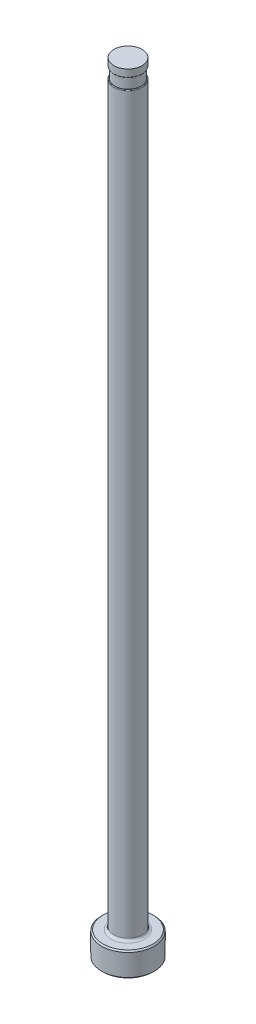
ISO-10303-21;
HEADER;
FILE_DESCRIPTION(('STEP AP214'),'2;1');
FILE_NAME('part.step','',(''),(''),'','','');
FILE_SCHEMA(('AUTOMOTIVE_DESIGN { 1 0 10303 214 1 1 1 1 }'));
ENDSEC;
DATA;
#1=APPLICATION_CONTEXT('core data for automotive mechanical design processes');
#2=APPLICATION_PROTOCOL_DEFINITION('international standard','automotive_design',2000,#1);
#3=PRODUCT_CONTEXT('',#1,'mechanical');
#4=PRODUCT('Part','Part','',(#3));
#5=PRODUCT_RELATED_PRODUCT_CATEGORY('part','',(#4));
#6=PRODUCT_DEFINITION_FORMATION('','',#4);
#7=PRODUCT_DEFINITION_CONTEXT('part definition',#1,'design');
#8=PRODUCT_DEFINITION('design','',#6,#7);
#9=PRODUCT_DEFINITION_SHAPE('','',#8);
#10=(LENGTH_UNIT() NAMED_UNIT(*) SI_UNIT(.MILLI.,.METRE.));
#11=(NAMED_UNIT(*) PLANE_ANGLE_UNIT() SI_UNIT($,.RADIAN.));
#12=(NAMED_UNIT(*) SI_UNIT($,.STERADIAN.) SOLID_ANGLE_UNIT());
#13=UNCERTAINTY_MEASURE_WITH_UNIT(LENGTH_MEASURE(1.E-05),#10,'distance_accuracy_value','');
#14=(GEOMETRIC_REPRESENTATION_CONTEXT(3) GLOBAL_UNCERTAINTY_ASSIGNED_CONTEXT((#13)) GLOBAL_UNIT_ASSIGNED_CONTEXT((#10,
#11,#12)) REPRESENTATION_CONTEXT('',''));
#15=CARTESIAN_POINT('',(0.,0.,0.));
#16=DIRECTION('',(0.,0.,1.));
#17=DIRECTION('',(1.,0.,0.));
#18=AXIS2_PLACEMENT_3D('',#15,#16,#17);
#19=CARTESIAN_POINT('',(-2.77748999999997,150.876,0.));
#20=DIRECTION('',(0.,1.,0.));
#21=DIRECTION('',(0.,0.,1.));
#22=AXIS2_PLACEMENT_3D('',#19,#20,#21);
#23=PLANE('',#22);
#24=CARTESIAN_POINT('',(0.,150.876,0.));
#25=DIRECTION('',(0.,1.,0.));
#26=DIRECTION('',(0.,0.,1.));
#27=AXIS2_PLACEMENT_3D('',#24,#25,#26);
#28=CIRCLE('',#27,2.62508999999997);
#29=CARTESIAN_POINT('',(0.,150.876,2.62508999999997));
#30=VERTEX_POINT('',#29);
#31=EDGE_CURVE('E11',#30,#30,#28,.F.);
#32=ORIENTED_EDGE('',*,*,#31,.T.);
#33=EDGE_LOOP('',(#32));
#34=FACE_BOUND('',#33,.T.);
#35=CARTESIAN_POINT('',(0.,150.876,0.));
#36=DIRECTION('',(0.,1.,0.));
#37=DIRECTION('',(0.,0.,1.));
#38=AXIS2_PLACEMENT_3D('',#35,#36,#37);
#39=CIRCLE('',#38,2.57428999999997);
#40=CARTESIAN_POINT('',(0.,150.876,2.57428999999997));
#41=VERTEX_POINT('',#40);
#42=EDGE_CURVE('E78',#41,#41,#39,.T.);
#43=ORIENTED_EDGE('',*,*,#42,.T.);
#44=EDGE_LOOP('',(#43));
#45=FACE_BOUND('',#44,.T.);
#46=ADVANCED_FACE('F36',(#34,#45),#23,.F.);
#47=CARTESIAN_POINT('',(0.,259.958771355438,0.));
#48=DIRECTION('',(0.,1.,0.));
#49=DIRECTION('',(0.,0.,1.));
#50=AXIS2_PLACEMENT_3D('',#47,#48,#49);
#51=CYLINDRICAL_SURFACE('',#50,2.77748999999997);
#52=DIRECTION('',(0.,1.,0.));
#53=VECTOR('',#52,1.);
#54=CARTESIAN_POINT('',(-2.57428999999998,259.958771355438,-1.04282390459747));
#55=LINE('',#54,#53);
#56=CARTESIAN_POINT('',(-2.57428999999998,148.717,-1.04282390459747));
#57=VERTEX_POINT('',#56);
#58=CARTESIAN_POINT('',(-2.57428999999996,86.36,-1.04282390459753));
#59=VERTEX_POINT('',#58);
#60=EDGE_CURVE('E73',#57,#59,#55,.F.);
#61=ORIENTED_EDGE('',*,*,#60,.F.);
#62=CARTESIAN_POINT('',(0.,148.717,0.));
#63=DIRECTION('',(0.,-1.,0.));
#64=DIRECTION('',(0.,0.,-1.));
#65=AXIS2_PLACEMENT_3D('',#62,#63,#64);
#66=CIRCLE('',#65,2.77748999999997);
#67=CARTESIAN_POINT('',(-2.57428999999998,148.717,1.04282390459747));
#68=VERTEX_POINT('',#67);
#69=EDGE_CURVE('E51',#57,#68,#66,.T.);
#70=ORIENTED_EDGE('',*,*,#69,.T.);
#71=DIRECTION('',(0.,1.,0.));
#72=VECTOR('',#71,1.);
#73=CARTESIAN_POINT('',(-2.57428999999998,259.958771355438,1.04282390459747));
#74=LINE('',#73,#72);
#75=CARTESIAN_POINT('',(-2.57428999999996,86.36,1.04282390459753));
#76=VERTEX_POINT('',#75);
#77=EDGE_CURVE('E84',#76,#68,#74,.T.);
#78=ORIENTED_EDGE('',*,*,#77,.F.);
#79=CARTESIAN_POINT('',(-2.57428999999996,86.36,-1.04282390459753));
#80=CARTESIAN_POINT('',(-2.57428787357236,86.3275852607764,-1.04282111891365));
#81=CARTESIAN_POINT('',(-2.57478701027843,86.2951850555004,-1.04159798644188));
#82=CARTESIAN_POINT('',(-2.57676382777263,86.2305964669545,-1.03670102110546));
#83=CARTESIAN_POINT('',(-2.57824163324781,86.198408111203,-1.03302687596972));
#84=CARTESIAN_POINT('',(-2.58411032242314,86.102391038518,-1.01830472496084));
#85=CARTESIAN_POINT('',(-2.58993639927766,86.0391681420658,-1.00355696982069));
#86=CARTESIAN_POINT('',(-2.60484835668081,85.9161975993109,-0.964186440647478));
#87=CARTESIAN_POINT('',(-2.61393879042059,85.8564549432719,-0.939549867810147));
#88=CARTESIAN_POINT('',(-2.63439257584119,85.7424330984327,-0.880565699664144));
#89=CARTESIAN_POINT('',(-2.64575368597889,85.6881486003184,-0.846227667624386));
#90=CARTESIAN_POINT('',(-2.66906948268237,85.5883648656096,-0.769463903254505));
#91=CARTESIAN_POINT('',(-2.68099701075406,85.542654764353,-0.727304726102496));
#92=CARTESIAN_POINT('',(-2.70429977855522,85.4597106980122,-0.63518612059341));
#93=CARTESIAN_POINT('',(-2.7156751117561,85.422475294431,-0.585228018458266));
#94=CARTESIAN_POINT('',(-2.73569711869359,85.3600565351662,-0.482647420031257));
#95=CARTESIAN_POINT('',(-2.74447837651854,85.3342160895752,-0.430450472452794));
#96=CARTESIAN_POINT('',(-2.75929586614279,85.2917915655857,-0.322059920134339));
#97=CARTESIAN_POINT('',(-2.76533294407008,85.2752046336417,-0.265867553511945));
#98=CARTESIAN_POINT('',(-2.77376309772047,85.2522965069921,-0.153923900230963));
#99=CARTESIAN_POINT('',(-2.77631330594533,85.2455317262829,-0.0982747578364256));
#100=CARTESIAN_POINT('',(-2.77801884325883,85.2409917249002,0.0134385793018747));
#101=CARTESIAN_POINT('',(-2.77717458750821,85.2432154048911,0.0695027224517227));
#102=CARTESIAN_POINT('',(-2.7722209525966,85.2564908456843,0.179520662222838));
#103=CARTESIAN_POINT('',(-2.76816343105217,85.2674024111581,0.233493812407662));
#104=CARTESIAN_POINT('',(-2.75726458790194,85.2976137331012,0.33873691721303));
#105=CARTESIAN_POINT('',(-2.7504233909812,85.3169131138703,0.390006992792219));
#106=CARTESIAN_POINT('',(-2.73459621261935,85.3635792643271,0.488834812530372));
#107=CARTESIAN_POINT('',(-2.7255949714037,85.3910037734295,0.536362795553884));
#108=CARTESIAN_POINT('',(-2.70638807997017,85.4531227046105,0.626118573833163));
#109=CARTESIAN_POINT('',(-2.69618232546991,85.4878177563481,0.668345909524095));
#110=CARTESIAN_POINT('',(-2.67522940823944,85.5647559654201,0.747895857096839));
#111=CARTESIAN_POINT('',(-2.66447542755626,85.6072077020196,0.785014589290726));
#112=CARTESIAN_POINT('',(-2.64380227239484,85.6976395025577,0.852053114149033));
#113=CARTESIAN_POINT('',(-2.63388340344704,85.7456215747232,0.88197027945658));
#114=CARTESIAN_POINT('',(-2.61524736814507,85.8488148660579,0.935839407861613));
#115=CARTESIAN_POINT('',(-2.60663744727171,85.9042867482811,0.959328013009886));
#116=CARTESIAN_POINT('',(-2.59218937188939,86.0184618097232,0.99771120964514));
#117=CARTESIAN_POINT('',(-2.58635078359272,86.0771644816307,1.01260714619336));
#118=CARTESIAN_POINT('',(-2.57955503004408,86.1735266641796,1.02975451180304));
#119=CARTESIAN_POINT('',(-2.57758531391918,86.2106676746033,1.03466198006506));
#120=CARTESIAN_POINT('',(-2.57495138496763,86.2852020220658,1.04119168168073));
#121=CARTESIAN_POINT('',(-2.57428434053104,86.3225946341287,1.04282104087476));
#122=CARTESIAN_POINT('',(-2.57428999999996,86.36,1.04282390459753));
#123=B_SPLINE_CURVE_WITH_KNOTS('',3,(#79,#80,#81,#82,#83,#84,#85,#86,#87,#88,#89,#90,#91,#92,
#93,#94,#95,#96,#97,#98,#99,#100,#101,#102,#103,#104,#105,#106,#107,#108,#109,#110,#111,#112,
#113,#114,#115,#116,#117,#118,#119,#120,#121,#122),.UNSPECIFIED.,.F.,.F.,(4,2,2,2,2,2,2,2,2,2,2,
2,2,2,2,2,2,2,2,2,2,4),(0.,0.0971880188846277,0.194388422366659,0.388960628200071,
0.583805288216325,0.778458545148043,0.96740640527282,1.1563221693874,1.33212671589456,
1.50787701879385,1.67541271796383,1.84292792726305,2.00779344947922,2.17265158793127,
2.33871056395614,2.5047839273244,2.67625192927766,2.84778239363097,3.02956415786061,
3.21131745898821,3.32371085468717,3.43585966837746),.UNSPECIFIED.);
#124=EDGE_CURVE('E81',#59,#76,#123,.T.);
#125=ORIENTED_EDGE('',*,*,#124,.F.);
#126=EDGE_LOOP('',(#61,#70,#78,#125));
#127=FACE_BOUND('',#126,.T.);
#128=CARTESIAN_POINT('',(0.,5.25779999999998,0.));
#129=DIRECTION('',(0.,1.,0.));
#130=DIRECTION('',(0.,0.,1.));
#131=AXIS2_PLACEMENT_3D('',#128,#129,#130);
#132=CIRCLE('',#131,2.77748999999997);
#133=CARTESIAN_POINT('',(0.,5.25779999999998,2.77748999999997));
#134=VERTEX_POINT('',#133);
#135=EDGE_CURVE('E116',#134,#134,#132,.T.);
#136=ORIENTED_EDGE('',*,*,#135,.T.);
#137=EDGE_LOOP('',(#136));
#138=FACE_BOUND('',#137,.T.);
#139=ADVANCED_FACE('F82',(#127,#138),#51,.T.);
#140=CARTESIAN_POINT('',(0.,0.,0.));
#141=DIRECTION('',(0.,-1.,0.));
#142=DIRECTION('',(0.,0.,-1.));
#143=AXIS2_PLACEMENT_3D('',#140,#141,#142);
#144=PLANE('',#143);
#145=CARTESIAN_POINT('',(0.,0.,0.));
#146=DIRECTION('',(0.,-1.,0.));
#147=DIRECTION('',(0.,0.,-1.));
#148=AXIS2_PLACEMENT_3D('',#145,#146,#147);
#149=CIRCLE('',#148,4.90220000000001);
#150=CARTESIAN_POINT('',(0.,0.,-4.90220000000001));
#151=VERTEX_POINT('',#150);
#152=EDGE_CURVE('E113',#151,#151,#149,.T.);
#153=ORIENTED_EDGE('',*,*,#152,.T.);
#154=EDGE_LOOP('',(#153));
#155=FACE_BOUND('',#154,.T.);
#156=ADVANCED_FACE('F192',(#155),#144,.T.);
#157=CARTESIAN_POINT('',(0.,259.958771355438,0.));
#158=DIRECTION('',(0.,1.,0.));
#159=DIRECTION('',(0.,0.,1.));
#160=AXIS2_PLACEMENT_3D('',#157,#158,#159);
#161=CYLINDRICAL_SURFACE('',#160,5.15619999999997);
#162=CARTESIAN_POINT('',(0.,4.49580000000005,0.));
#163=DIRECTION('',(0.,1.,0.));
#164=DIRECTION('',(0.,0.,1.));
#165=AXIS2_PLACEMENT_3D('',#162,#163,#164);
#166=CIRCLE('',#165,5.15619999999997);
#167=CARTESIAN_POINT('',(0.,4.49580000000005,5.15619999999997));
#168=VERTEX_POINT('',#167);
#169=EDGE_CURVE('E110',#168,#168,#166,.F.);
#170=ORIENTED_EDGE('',*,*,#169,.T.);
#171=EDGE_LOOP('',(#170));
#172=FACE_BOUND('',#171,.T.);
#173=CARTESIAN_POINT('',(0.,0.253999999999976,0.));
#174=DIRECTION('',(0.,-1.,0.));
#175=DIRECTION('',(0.,0.,-1.));
#176=AXIS2_PLACEMENT_3D('',#173,#174,#175);
#177=CIRCLE('',#176,5.15619999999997);
#178=CARTESIAN_POINT('',(0.,0.253999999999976,-5.15619999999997));
#179=VERTEX_POINT('',#178);
#180=EDGE_CURVE('E107',#179,#179,#177,.F.);
#181=ORIENTED_EDGE('',*,*,#180,.T.);
#182=EDGE_LOOP('',(#181));
#183=FACE_BOUND('',#182,.T.);
#184=ADVANCED_FACE('F195',(#172,#183),#161,.T.);
#185=CARTESIAN_POINT('',(-5.15619999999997,4.7498,0.));
#186=DIRECTION('',(0.,1.,0.));
#187=DIRECTION('',(0.,0.,1.));
#188=AXIS2_PLACEMENT_3D('',#185,#186,#187);
#189=PLANE('',#188);
#190=CARTESIAN_POINT('',(0.,4.7498,0.));
#191=DIRECTION('',(0.,1.,0.));
#192=DIRECTION('',(0.,0.,1.));
#193=AXIS2_PLACEMENT_3D('',#190,#191,#192);
#194=CIRCLE('',#193,3.28548999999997);
#195=CARTESIAN_POINT('',(0.,4.7498,3.28548999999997));
#196=VERTEX_POINT('',#195);
#197=EDGE_CURVE('E87',#196,#196,#194,.F.);
#198=ORIENTED_EDGE('',*,*,#197,.T.);
#199=EDGE_LOOP('',(#198));
#200=FACE_BOUND('',#199,.T.);
#201=CARTESIAN_POINT('',(0.,4.7498,0.));
#202=DIRECTION('',(0.,1.,0.));
#203=DIRECTION('',(0.,0.,1.));
#204=AXIS2_PLACEMENT_3D('',#201,#202,#203);
#205=CIRCLE('',#204,4.90220000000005);
#206=CARTESIAN_POINT('',(0.,4.7498,4.90220000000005));
#207=VERTEX_POINT('',#206);
#208=EDGE_CURVE('E104',#207,#207,#205,.T.);
#209=ORIENTED_EDGE('',*,*,#208,.T.);
#210=EDGE_LOOP('',(#209));
#211=FACE_BOUND('',#210,.T.);
#212=ADVANCED_FACE('F190',(#200,#211),#189,.T.);
#213=CARTESIAN_POINT('',(0.,4.74980000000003,0.));
#214=DIRECTION('',(0.,-1.,0.));
#215=DIRECTION('',(0.,0.,-1.));
#216=AXIS2_PLACEMENT_3D('',#213,#214,#215);
#217=CONICAL_SURFACE('',#216,4.90220000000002,0.785398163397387);
#218=ORIENTED_EDGE('',*,*,#169,.F.);
#219=EDGE_LOOP('',(#218));
#220=FACE_BOUND('',#219,.T.);
#221=ORIENTED_EDGE('',*,*,#208,.F.);
#222=EDGE_LOOP('',(#221));
#223=FACE_BOUND('',#222,.T.);
#224=ADVANCED_FACE('F186',(#220,#223),#217,.T.);
#225=CARTESIAN_POINT('',(0.,0.253999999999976,0.));
#226=DIRECTION('',(0.,1.,0.));
#227=DIRECTION('',(0.,0.,1.));
#228=AXIS2_PLACEMENT_3D('',#225,#226,#227);
#229=CONICAL_SURFACE('',#228,5.15619999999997,0.785398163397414);
#230=ORIENTED_EDGE('',*,*,#152,.F.);
#231=EDGE_LOOP('',(#230));
#232=FACE_BOUND('',#231,.T.);
#233=ORIENTED_EDGE('',*,*,#180,.F.);
#234=EDGE_LOOP('',(#233));
#235=FACE_BOUND('',#234,.T.);
#236=ADVANCED_FACE('F182',(#232,#235),#229,.T.);
#237=CARTESIAN_POINT('',(0.,5.25779999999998,0.));
#238=DIRECTION('',(0.,1.,0.));
#239=DIRECTION('',(0.,0.,1.));
#240=AXIS2_PLACEMENT_3D('',#237,#238,#239);
#241=TOROIDAL_SURFACE('',#240,3.28548999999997,0.508);
#242=ORIENTED_EDGE('',*,*,#197,.F.);
#243=EDGE_LOOP('',(#242));
#244=FACE_BOUND('',#243,.T.);
#245=ORIENTED_EDGE('',*,*,#135,.F.);
#246=EDGE_LOOP('',(#245));
#247=FACE_BOUND('',#246,.T.);
#248=ADVANCED_FACE('F147',(#244,#247),#241,.F.);
#249=CARTESIAN_POINT('',(-2.77748999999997,148.844,0.));
#250=DIRECTION('',(0.,-1.,0.));
#251=DIRECTION('',(0.,0.,-1.));
#252=AXIS2_PLACEMENT_3D('',#249,#250,#251);
#253=PLANE('',#252);
#254=DIRECTION('',(0.,0.,1.));
#255=VECTOR('',#254,1.);
#256=CARTESIAN_POINT('',(-2.57428999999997,148.844,0.));
#257=LINE('',#256,#255);
#258=CARTESIAN_POINT('',(-2.57428999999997,148.844,0.));
#259=VERTEX_POINT('',#258);
#260=CARTESIAN_POINT('',(-2.57428999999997,148.844,0.630974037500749));
#261=VERTEX_POINT('',#260);
#262=EDGE_CURVE('E90',#259,#261,#257,.T.);
#263=ORIENTED_EDGE('',*,*,#262,.T.);
#264=CARTESIAN_POINT('',(0.,148.844,0.));
#265=DIRECTION('',(0.,-1.,0.));
#266=DIRECTION('',(0.,0.,-1.));
#267=AXIS2_PLACEMENT_3D('',#264,#265,#266);
#268=CIRCLE('',#267,2.65048999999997);
#269=CARTESIAN_POINT('',(-2.57428999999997,148.844,-0.630974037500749));
#270=VERTEX_POINT('',#269);
#271=EDGE_CURVE('E86',#261,#270,#268,.F.);
#272=ORIENTED_EDGE('',*,*,#271,.T.);
#273=EDGE_CURVE('E79',#270,#259,#257,.T.);
#274=ORIENTED_EDGE('',*,*,#273,.T.);
#275=CARTESIAN_POINT('',(0.,148.844,0.));
#276=DIRECTION('',(0.,1.,0.));
#277=DIRECTION('',(0.,0.,1.));
#278=AXIS2_PLACEMENT_3D('',#275,#276,#277);
#279=CIRCLE('',#278,2.57428999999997);
#280=EDGE_CURVE('E101',#259,#259,#279,.T.);
#281=ORIENTED_EDGE('',*,*,#280,.F.);
#282=EDGE_LOOP('',(#263,#272,#274,#281));
#283=FACE_BOUND('',#282,.T.);
#284=ADVANCED_FACE('F144',(#283),#253,.F.);
#285=CARTESIAN_POINT('',(0.,153.448281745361,0.));
#286=DIRECTION('',(0.,1.,0.));
#287=DIRECTION('',(0.,0.,1.));
#288=AXIS2_PLACEMENT_3D('',#285,#286,#287);
#289=CYLINDRICAL_SURFACE('',#288,2.57428999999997);
#290=ORIENTED_EDGE('',*,*,#42,.F.);
#291=EDGE_LOOP('',(#290));
#292=FACE_BOUND('',#291,.T.);
#293=ORIENTED_EDGE('',*,*,#280,.T.);
#294=EDGE_LOOP('',(#293));
#295=FACE_BOUND('',#294,.T.);
#296=ADVANCED_FACE('F141',(#292,#295),#289,.T.);
#297=CARTESIAN_POINT('',(-2.57428999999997,149.86,-5.15619999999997));
#298=DIRECTION('',(1.,0.,0.));
#299=DIRECTION('',(0.,1.,0.));
#300=AXIS2_PLACEMENT_3D('',#297,#298,#299);
#301=PLANE('',#300);
#302=ORIENTED_EDGE('',*,*,#273,.F.);
#303=CARTESIAN_POINT('',(-2.57428999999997,148.844,-0.630974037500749));
#304=CARTESIAN_POINT('',(-2.57428999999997,148.843988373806,-0.652186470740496));
#305=CARTESIAN_POINT('',(-2.57428999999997,148.843697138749,-0.67340907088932));
#306=CARTESIAN_POINT('',(-2.57428999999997,148.842309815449,-0.715909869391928));
#307=CARTESIAN_POINT('',(-2.57428999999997,148.841210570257,-0.737187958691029));
#308=CARTESIAN_POINT('',(-2.57428999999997,148.837955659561,-0.779696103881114));
#309=CARTESIAN_POINT('',(-2.57428999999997,148.835798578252,-0.800926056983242));
#310=CARTESIAN_POINT('',(-2.57428999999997,148.830053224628,-0.843171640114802));
#311=CARTESIAN_POINT('',(-2.57428999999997,148.826467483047,-0.864187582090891));
#312=CARTESIAN_POINT('',(-2.57428999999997,148.81967465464,-0.894737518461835));
#313=CARTESIAN_POINT('',(-2.57428999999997,148.817275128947,-0.904450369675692));
#314=CARTESIAN_POINT('',(-2.57428999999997,148.811899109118,-0.923745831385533));
#315=CARTESIAN_POINT('',(-2.57428999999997,148.808921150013,-0.93332804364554));
#316=CARTESIAN_POINT('',(-2.57428999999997,148.801733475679,-0.95367532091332));
#317=CARTESIAN_POINT('',(-2.57428999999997,148.797405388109,-0.964399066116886));
#318=CARTESIAN_POINT('',(-2.57428999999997,148.787429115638,-0.985202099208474));
#319=CARTESIAN_POINT('',(-2.57428999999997,148.781787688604,-0.995284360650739));
#320=CARTESIAN_POINT('',(-2.57428999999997,148.772621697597,-1.00826014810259));
#321=CARTESIAN_POINT('',(-2.57428999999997,148.769943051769,-1.01174615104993));
#322=CARTESIAN_POINT('',(-2.57428999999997,148.764228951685,-1.01843326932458));
#323=CARTESIAN_POINT('',(-2.57428999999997,148.761192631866,-1.02163365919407));
#324=CARTESIAN_POINT('',(-2.57428999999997,148.754665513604,-1.02764631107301));
#325=CARTESIAN_POINT('',(-2.57428999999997,148.751168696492,-1.03045218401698));
#326=CARTESIAN_POINT('',(-2.57428999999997,148.743739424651,-1.03537629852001));
#327=CARTESIAN_POINT('',(-2.57428999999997,148.739810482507,-1.03749960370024));
#328=CARTESIAN_POINT('',(-2.57428999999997,148.732740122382,-1.04030637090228));
#329=CARTESIAN_POINT('',(-2.57428999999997,148.72969508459,-1.04122798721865));
#330=CARTESIAN_POINT('',(-2.57428999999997,148.723439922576,-1.04249667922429));
#331=CARTESIAN_POINT('',(-2.57428999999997,148.720227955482,-1.04283449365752));
#332=CARTESIAN_POINT('',(-2.57428999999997,148.717,-1.04282390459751));
#333=B_SPLINE_CURVE_WITH_KNOTS('',3,(#303,#304,#305,#306,#307,#308,#309,#310,#311,#312,#313,
#314,#315,#316,#317,#318,#319,#320,#321,#322,#323,#324,#325,#326,#327,#328,#329,#330,#331,#332),
.UNSPECIFIED.,.F.,.F.,(4,2,2,2,2,2,2,2,2,2,2,2,2,2,4),(0.,0.0636515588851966,0.127553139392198,
0.191540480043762,0.255414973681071,0.285417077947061,0.315496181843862,0.350142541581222,
0.384614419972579,0.397785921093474,0.410989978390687,0.424387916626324,0.437684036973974,
0.447175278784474,0.45681575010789),.UNSPECIFIED.);
#334=EDGE_CURVE('E59',#270,#57,#333,.T.);
#335=ORIENTED_EDGE('',*,*,#334,.T.);
#336=ORIENTED_EDGE('',*,*,#60,.T.);
#337=DIRECTION('',(0.,0.,1.));
#338=VECTOR('',#337,1.);
#339=CARTESIAN_POINT('',(-2.57428999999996,86.36,-5.15619999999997));
#340=LINE('',#339,#338);
#341=EDGE_CURVE('E77',#59,#76,#340,.T.);
#342=ORIENTED_EDGE('',*,*,#341,.T.);
#343=ORIENTED_EDGE('',*,*,#77,.T.);
#344=CARTESIAN_POINT('',(-2.57428999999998,148.717,1.04282390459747));
#345=CARTESIAN_POINT('',(-2.57428999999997,148.719997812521,1.04283236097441));
#346=CARTESIAN_POINT('',(-2.57428999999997,148.722984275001,1.04254163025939));
#347=CARTESIAN_POINT('',(-2.57428999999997,148.72882304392,1.04144104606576));
#348=CARTESIAN_POINT('',(-2.57428999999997,148.731676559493,1.04063771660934));
#349=CARTESIAN_POINT('',(-2.57428999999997,148.737880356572,1.03834208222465));
#350=CARTESIAN_POINT('',(-2.57428999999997,148.741185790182,1.03673079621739));
#351=CARTESIAN_POINT('',(-2.57428999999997,148.747505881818,1.03299596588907));
#352=CARTESIAN_POINT('',(-2.57428999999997,148.750518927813,1.03086978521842));
#353=CARTESIAN_POINT('',(-2.57428999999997,148.758062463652,1.02479237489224));
#354=CARTESIAN_POINT('',(-2.57428999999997,148.762345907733,1.02053793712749));
#355=CARTESIAN_POINT('',(-2.57428999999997,148.770251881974,1.01146538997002));
#356=CARTESIAN_POINT('',(-2.57428999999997,148.773873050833,1.00664615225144));
#357=CARTESIAN_POINT('',(-2.57428999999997,148.784266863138,0.991217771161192));
#358=CARTESIAN_POINT('',(-2.57428999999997,148.790166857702,0.980028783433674));
#359=CARTESIAN_POINT('',(-2.57428999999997,148.800501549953,0.957006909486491));
#360=CARTESIAN_POINT('',(-2.57428999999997,148.804931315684,0.945172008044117));
#361=CARTESIAN_POINT('',(-2.57428999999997,148.815366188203,0.913140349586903));
#362=CARTESIAN_POINT('',(-2.57428999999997,148.820443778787,0.892644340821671));
#363=CARTESIAN_POINT('',(-2.57428999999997,148.828753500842,0.851271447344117));
#364=CARTESIAN_POINT('',(-2.57428999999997,148.831981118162,0.830393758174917));
#365=CARTESIAN_POINT('',(-2.57428999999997,148.839717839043,0.767434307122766));
#366=CARTESIAN_POINT('',(-2.57428999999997,148.842259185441,0.725112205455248));
#367=CARTESIAN_POINT('',(-2.57428999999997,148.843575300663,0.674152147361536));
#368=CARTESIAN_POINT('',(-2.57428999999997,148.843738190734,0.665497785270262));
#369=CARTESIAN_POINT('',(-2.57428999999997,148.843950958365,0.648220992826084));
#370=CARTESIAN_POINT('',(-2.57428999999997,148.84400126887,0.639598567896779));
#371=CARTESIAN_POINT('',(-2.57428999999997,148.844,0.63097403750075));
#372=B_SPLINE_CURVE_WITH_KNOTS('',3,(#344,#345,#346,#347,#348,#349,#350,#351,#352,#353,#354,
#355,#356,#357,#358,#359,#360,#361,#362,#363,#364,#365,#366,#367,#368,#369,#370,#371),
.UNSPECIFIED.,.F.,.F.,(4,2,2,2,2,2,2,2,2,2,2,2,2,4),(0.,0.00896107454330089,0.0178103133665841,
0.0287804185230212,0.0398079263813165,0.0578172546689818,0.0758631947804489,0.113599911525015,
0.151461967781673,0.214643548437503,0.277978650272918,0.404912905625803,0.430882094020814,
0.45675124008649),.UNSPECIFIED.);
#373=EDGE_CURVE('E172',#68,#261,#372,.T.);
#374=ORIENTED_EDGE('',*,*,#373,.T.);
#375=ORIENTED_EDGE('',*,*,#262,.F.);
#376=EDGE_LOOP('',(#302,#335,#336,#342,#343,#374,#375));
#377=FACE_BOUND('',#376,.T.);
#378=ADVANCED_FACE('F75',(#377),#301,.F.);
#379=CARTESIAN_POINT('',(-5.74928999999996,86.36,-5.15619999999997));
#380=DIRECTION('',(0.,0.,1.));
#381=DIRECTION('',(1.,0.,0.));
#382=AXIS2_PLACEMENT_3D('',#379,#380,#381);
#383=CYLINDRICAL_SURFACE('',#382,3.175);
#384=ORIENTED_EDGE('',*,*,#341,.F.);
#385=ORIENTED_EDGE('',*,*,#124,.T.);
#386=EDGE_LOOP('',(#384,#385));
#387=FACE_BOUND('',#386,.T.);
#388=ADVANCED_FACE('F89',(#387),#383,.F.);
#389=CARTESIAN_POINT('',(0.,152.687735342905,0.));
#390=DIRECTION('',(0.,1.,0.));
#391=DIRECTION('',(0.,0.,1.));
#392=AXIS2_PLACEMENT_3D('',#389,#390,#391);
#393=CYLINDRICAL_SURFACE('',#392,2.75208999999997);
#394=CARTESIAN_POINT('',(0.,151.003,0.));
#395=DIRECTION('',(0.,1.,0.));
#396=DIRECTION('',(0.,0.,1.));
#397=AXIS2_PLACEMENT_3D('',#394,#395,#396);
#398=CIRCLE('',#397,2.75208999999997);
#399=CARTESIAN_POINT('',(0.,151.003,2.75208999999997));
#400=VERTEX_POINT('',#399);
#401=EDGE_CURVE('E44',#400,#400,#398,.T.);
#402=ORIENTED_EDGE('',*,*,#401,.T.);
#403=EDGE_LOOP('',(#402));
#404=FACE_BOUND('',#403,.T.);
#405=CARTESIAN_POINT('',(0.,152.4,0.));
#406=DIRECTION('',(0.,1.,0.));
#407=DIRECTION('',(0.,0.,1.));
#408=AXIS2_PLACEMENT_3D('',#405,#406,#407);
#409=CIRCLE('',#408,2.75208999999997);
#410=CARTESIAN_POINT('',(0.,152.4,2.75208999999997));
#411=VERTEX_POINT('',#410);
#412=EDGE_CURVE('E91',#411,#411,#409,.T.);
#413=ORIENTED_EDGE('',*,*,#412,.F.);
#414=EDGE_LOOP('',(#413));
#415=FACE_BOUND('',#414,.T.);
#416=ADVANCED_FACE('F135',(#404,#415),#393,.T.);
#417=CARTESIAN_POINT('',(-2.77748999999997,152.4,0.));
#418=DIRECTION('',(0.,1.,0.));
#419=DIRECTION('',(0.,0.,1.));
#420=AXIS2_PLACEMENT_3D('',#417,#418,#419);
#421=PLANE('',#420);
#422=ORIENTED_EDGE('',*,*,#412,.T.);
#423=EDGE_LOOP('',(#422));
#424=FACE_BOUND('',#423,.T.);
#425=ADVANCED_FACE('F149',(#424),#421,.T.);
#426=CARTESIAN_POINT('',(0.,148.717,0.));
#427=DIRECTION('',(0.,-1.,0.));
#428=DIRECTION('',(0.,0.,-1.));
#429=AXIS2_PLACEMENT_3D('',#426,#427,#428);
#430=TOROIDAL_SURFACE('',#429,2.65048999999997,0.127);
#431=ORIENTED_EDGE('',*,*,#373,.F.);
#432=ORIENTED_EDGE('',*,*,#69,.F.);
#433=ORIENTED_EDGE('',*,*,#334,.F.);
#434=ORIENTED_EDGE('',*,*,#271,.F.);
#435=EDGE_LOOP('',(#431,#432,#433,#434));
#436=FACE_BOUND('',#435,.T.);
#437=ADVANCED_FACE('F151',(#436),#430,.T.);
#438=CARTESIAN_POINT('',(0.,151.003,0.));
#439=DIRECTION('',(0.,1.,0.));
#440=DIRECTION('',(0.,0.,1.));
#441=AXIS2_PLACEMENT_3D('',#438,#439,#440);
#442=TOROIDAL_SURFACE('',#441,2.62508999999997,0.127);
#443=ORIENTED_EDGE('',*,*,#31,.F.);
#444=EDGE_LOOP('',(#443));
#445=FACE_BOUND('',#444,.T.);
#446=ORIENTED_EDGE('',*,*,#401,.F.);
#447=EDGE_LOOP('',(#446));
#448=FACE_BOUND('',#447,.T.);
#449=ADVANCED_FACE('F38',(#445,#448),#442,.T.);
#450=CLOSED_SHELL('',(#46,#139,#156,#184,#212,#224,#236,#248,#284,#296,#378,#388,#416,#425,#437,#449));
#451=MANIFOLD_SOLID_BREP('B2',#450);
#452=ADVANCED_BREP_SHAPE_REPRESENTATION('',(#18,#451),#14);
#453=SHAPE_DEFINITION_REPRESENTATION(#9,#452);
ENDSEC;
END-ISO-10303-21;
